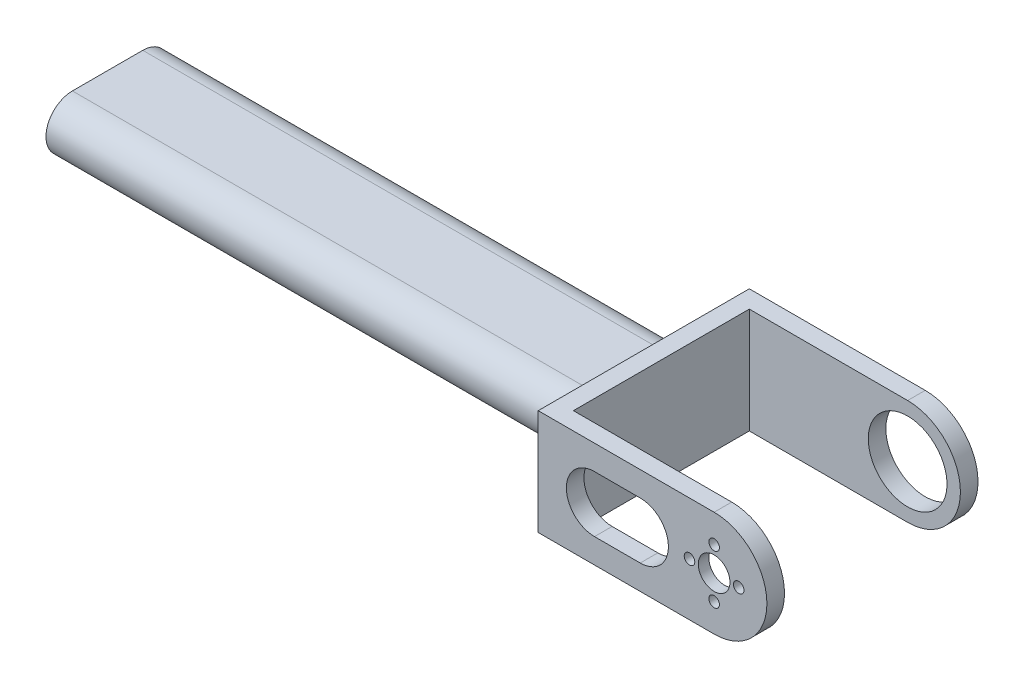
ISO-10303-21;
HEADER;
FILE_DESCRIPTION(('STEP AP214'),'2;1');
FILE_NAME('part.step','',(''),(''),'','','');
FILE_SCHEMA(('AUTOMOTIVE_DESIGN { 1 0 10303 214 1 1 1 1 }'));
ENDSEC;
DATA;
#1=APPLICATION_CONTEXT('core data for automotive mechanical design processes');
#2=APPLICATION_PROTOCOL_DEFINITION('international standard','automotive_design',2000,#1);
#3=PRODUCT_CONTEXT('',#1,'mechanical');
#4=PRODUCT('Part','Part','',(#3));
#5=PRODUCT_RELATED_PRODUCT_CATEGORY('part','',(#4));
#6=PRODUCT_DEFINITION_FORMATION('','',#4);
#7=PRODUCT_DEFINITION_CONTEXT('part definition',#1,'design');
#8=PRODUCT_DEFINITION('design','',#6,#7);
#9=PRODUCT_DEFINITION_SHAPE('','',#8);
#10=(LENGTH_UNIT() NAMED_UNIT(*) SI_UNIT(.MILLI.,.METRE.));
#11=(NAMED_UNIT(*) PLANE_ANGLE_UNIT() SI_UNIT($,.RADIAN.));
#12=(NAMED_UNIT(*) SI_UNIT($,.STERADIAN.) SOLID_ANGLE_UNIT());
#13=UNCERTAINTY_MEASURE_WITH_UNIT(LENGTH_MEASURE(1.E-05),#10,'distance_accuracy_value','');
#14=(GEOMETRIC_REPRESENTATION_CONTEXT(3) GLOBAL_UNCERTAINTY_ASSIGNED_CONTEXT((#13)) GLOBAL_UNIT_ASSIGNED_CONTEXT((#10,
#11,#12)) REPRESENTATION_CONTEXT('',''));
#15=CARTESIAN_POINT('',(0.,0.,0.));
#16=DIRECTION('',(0.,0.,1.));
#17=DIRECTION('',(1.,0.,0.));
#18=AXIS2_PLACEMENT_3D('',#15,#16,#17);
#19=CARTESIAN_POINT('',(-50.,15.,5.));
#20=DIRECTION('',(1.,0.,0.));
#21=DIRECTION('',(0.,0.,-1.));
#22=AXIS2_PLACEMENT_3D('',#19,#20,#21);
#23=PLANE('',#22);
#24=DIRECTION('',(0.,1.,0.));
#25=VECTOR('',#24,1.);
#26=CARTESIAN_POINT('',(-50.,15.,-55.));
#27=LINE('',#26,#25);
#28=CARTESIAN_POINT('',(-50.,-15.,-55.));
#29=VERTEX_POINT('',#28);
#30=CARTESIAN_POINT('',(-50.,15.,-55.));
#31=VERTEX_POINT('',#30);
#32=EDGE_CURVE('E375',#29,#31,#27,.T.);
#33=ORIENTED_EDGE('',*,*,#32,.F.);
#34=DIRECTION('',(0.,0.,-1.));
#35=VECTOR('',#34,1.);
#36=CARTESIAN_POINT('',(-50.,-15.,5.));
#37=LINE('',#36,#35);
#38=CARTESIAN_POINT('',(-50.,-15.,5.));
#39=VERTEX_POINT('',#38);
#40=EDGE_CURVE('E443',#39,#29,#37,.T.);
#41=ORIENTED_EDGE('',*,*,#40,.F.);
#42=DIRECTION('',(0.,-1.,0.));
#43=VECTOR('',#42,1.);
#44=CARTESIAN_POINT('',(-50.,15.,5.));
#45=LINE('',#44,#43);
#46=CARTESIAN_POINT('',(-50.,15.,5.));
#47=VERTEX_POINT('',#46);
#48=EDGE_CURVE('E424',#47,#39,#45,.T.);
#49=ORIENTED_EDGE('',*,*,#48,.F.);
#50=DIRECTION('',(0.,0.,-1.));
#51=VECTOR('',#50,1.);
#52=CARTESIAN_POINT('',(-50.,15.,5.));
#53=LINE('',#52,#51);
#54=EDGE_CURVE('E446',#47,#31,#53,.T.);
#55=ORIENTED_EDGE('',*,*,#54,.T.);
#56=EDGE_LOOP('',(#33,#41,#49,#55));
#57=FACE_BOUND('',#56,.T.);
#58=CARTESIAN_POINT('',(-50.,0.,-35.));
#59=DIRECTION('',(-1.,0.,0.));
#60=DIRECTION('',(0.,0.,1.));
#61=AXIS2_PLACEMENT_3D('',#58,#59,#60);
#62=CIRCLE('',#61,7.5);
#63=CARTESIAN_POINT('',(-50.,7.5,-35.));
#64=VERTEX_POINT('',#63);
#65=CARTESIAN_POINT('',(-50.,-7.5,-35.));
#66=VERTEX_POINT('',#65);
#67=EDGE_CURVE('E71',#64,#66,#62,.T.);
#68=ORIENTED_EDGE('',*,*,#67,.F.);
#69=DIRECTION('',(0.,0.,-1.));
#70=VECTOR('',#69,1.);
#71=CARTESIAN_POINT('',(-50.,7.5,-35.));
#72=LINE('',#71,#70);
#73=CARTESIAN_POINT('',(-50.,7.5,-15.));
#74=VERTEX_POINT('',#73);
#75=EDGE_CURVE('E240',#74,#64,#72,.T.);
#76=ORIENTED_EDGE('',*,*,#75,.F.);
#77=CARTESIAN_POINT('',(-50.,0.,-15.));
#78=DIRECTION('',(-1.,0.,0.));
#79=DIRECTION('',(0.,0.,1.));
#80=AXIS2_PLACEMENT_3D('',#77,#78,#79);
#81=CIRCLE('',#80,7.5);
#82=CARTESIAN_POINT('',(-50.,-7.5,-15.));
#83=VERTEX_POINT('',#82);
#84=EDGE_CURVE('E256',#83,#74,#81,.T.);
#85=ORIENTED_EDGE('',*,*,#84,.F.);
#86=DIRECTION('',(0.,0.,1.));
#87=VECTOR('',#86,1.);
#88=CARTESIAN_POINT('',(-50.,-7.5,-35.));
#89=LINE('',#88,#87);
#90=EDGE_CURVE('E252',#66,#83,#89,.T.);
#91=ORIENTED_EDGE('',*,*,#90,.F.);
#92=EDGE_LOOP('',(#68,#76,#85,#91));
#93=FACE_BOUND('',#92,.T.);
#94=ADVANCED_FACE('F46',(#57,#93),#23,.F.);
#95=CARTESIAN_POINT('',(0.,0.,5.));
#96=DIRECTION('',(0.,0.,-1.));
#97=DIRECTION('',(-1.,0.,0.));
#98=AXIS2_PLACEMENT_3D('',#95,#96,#97);
#99=CYLINDRICAL_SURFACE('',#98,4.5);
#100=CARTESIAN_POINT('',(0.,0.,5.));
#101=DIRECTION('',(0.,0.,1.));
#102=DIRECTION('',(1.,0.,0.));
#103=AXIS2_PLACEMENT_3D('',#100,#101,#102);
#104=CIRCLE('',#103,4.5);
#105=CARTESIAN_POINT('',(4.5,0.,5.));
#106=VERTEX_POINT('',#105);
#107=EDGE_CURVE('E411',#106,#106,#104,.T.);
#108=ORIENTED_EDGE('',*,*,#107,.T.);
#109=EDGE_LOOP('',(#108));
#110=FACE_BOUND('',#109,.T.);
#111=CARTESIAN_POINT('',(0.,0.,2.));
#112=DIRECTION('',(0.,0.,-1.));
#113=DIRECTION('',(-1.,0.,0.));
#114=AXIS2_PLACEMENT_3D('',#111,#112,#113);
#115=CIRCLE('',#114,4.5);
#116=CARTESIAN_POINT('',(-4.5,0.,2.));
#117=VERTEX_POINT('',#116);
#118=EDGE_CURVE('E348',#117,#117,#115,.T.);
#119=ORIENTED_EDGE('',*,*,#118,.T.);
#120=EDGE_LOOP('',(#119));
#121=FACE_BOUND('',#120,.T.);
#122=ADVANCED_FACE('F501',(#110,#121),#99,.F.);
#123=CARTESIAN_POINT('',(0.,7.,5.));
#124=DIRECTION('',(0.,0.,-1.));
#125=DIRECTION('',(-1.,0.,0.));
#126=AXIS2_PLACEMENT_3D('',#123,#124,#125);
#127=CYLINDRICAL_SURFACE('',#126,1.5);
#128=CARTESIAN_POINT('',(0.,7.,5.));
#129=DIRECTION('',(0.,0.,1.));
#130=DIRECTION('',(1.,0.,0.));
#131=AXIS2_PLACEMENT_3D('',#128,#129,#130);
#132=CIRCLE('',#131,1.5);
#133=CARTESIAN_POINT('',(1.5,7.,5.));
#134=VERTEX_POINT('',#133);
#135=EDGE_CURVE('E407',#134,#134,#132,.T.);
#136=ORIENTED_EDGE('',*,*,#135,.T.);
#137=EDGE_LOOP('',(#136));
#138=FACE_BOUND('',#137,.T.);
#139=CARTESIAN_POINT('',(0.,7.,2.));
#140=DIRECTION('',(0.,0.,-1.));
#141=DIRECTION('',(-1.,0.,0.));
#142=AXIS2_PLACEMENT_3D('',#139,#140,#141);
#143=CIRCLE('',#142,1.5);
#144=CARTESIAN_POINT('',(-1.5,7.,2.));
#145=VERTEX_POINT('',#144);
#146=EDGE_CURVE('E344',#145,#145,#143,.T.);
#147=ORIENTED_EDGE('',*,*,#146,.T.);
#148=EDGE_LOOP('',(#147));
#149=FACE_BOUND('',#148,.T.);
#150=ADVANCED_FACE('F507',(#138,#149),#127,.F.);
#151=CARTESIAN_POINT('',(7.,0.,5.));
#152=DIRECTION('',(0.,0.,-1.));
#153=DIRECTION('',(-1.,0.,0.));
#154=AXIS2_PLACEMENT_3D('',#151,#152,#153);
#155=CYLINDRICAL_SURFACE('',#154,1.5);
#156=CARTESIAN_POINT('',(7.,0.,5.));
#157=DIRECTION('',(0.,0.,1.));
#158=DIRECTION('',(1.,0.,0.));
#159=AXIS2_PLACEMENT_3D('',#156,#157,#158);
#160=CIRCLE('',#159,1.5);
#161=CARTESIAN_POINT('',(8.5,0.,5.));
#162=VERTEX_POINT('',#161);
#163=EDGE_CURVE('E403',#162,#162,#160,.T.);
#164=ORIENTED_EDGE('',*,*,#163,.T.);
#165=EDGE_LOOP('',(#164));
#166=FACE_BOUND('',#165,.T.);
#167=CARTESIAN_POINT('',(7.,0.,2.));
#168=DIRECTION('',(0.,0.,-1.));
#169=DIRECTION('',(-1.,0.,0.));
#170=AXIS2_PLACEMENT_3D('',#167,#168,#169);
#171=CIRCLE('',#170,1.5);
#172=CARTESIAN_POINT('',(5.5,0.,2.));
#173=VERTEX_POINT('',#172);
#174=EDGE_CURVE('E340',#173,#173,#171,.T.);
#175=ORIENTED_EDGE('',*,*,#174,.T.);
#176=EDGE_LOOP('',(#175));
#177=FACE_BOUND('',#176,.T.);
#178=ADVANCED_FACE('F513',(#166,#177),#155,.F.);
#179=CARTESIAN_POINT('',(0.,-7.,5.));
#180=DIRECTION('',(0.,0.,-1.));
#181=DIRECTION('',(-1.,0.,0.));
#182=AXIS2_PLACEMENT_3D('',#179,#180,#181);
#183=CYLINDRICAL_SURFACE('',#182,1.5);
#184=CARTESIAN_POINT('',(0.,-7.,5.));
#185=DIRECTION('',(0.,0.,1.));
#186=DIRECTION('',(1.,0.,0.));
#187=AXIS2_PLACEMENT_3D('',#184,#185,#186);
#188=CIRCLE('',#187,1.5);
#189=CARTESIAN_POINT('',(1.49999999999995,-7.,5.));
#190=VERTEX_POINT('',#189);
#191=EDGE_CURVE('E399',#190,#190,#188,.T.);
#192=ORIENTED_EDGE('',*,*,#191,.T.);
#193=EDGE_LOOP('',(#192));
#194=FACE_BOUND('',#193,.T.);
#195=CARTESIAN_POINT('',(0.,-7.,2.));
#196=DIRECTION('',(0.,0.,-1.));
#197=DIRECTION('',(-1.,0.,0.));
#198=AXIS2_PLACEMENT_3D('',#195,#196,#197);
#199=CIRCLE('',#198,1.5);
#200=CARTESIAN_POINT('',(-1.50000000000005,-7.,2.));
#201=VERTEX_POINT('',#200);
#202=EDGE_CURVE('E336',#201,#201,#199,.T.);
#203=ORIENTED_EDGE('',*,*,#202,.T.);
#204=EDGE_LOOP('',(#203));
#205=FACE_BOUND('',#204,.T.);
#206=ADVANCED_FACE('F554',(#194,#205),#183,.F.);
#207=CARTESIAN_POINT('',(-7.,0.,5.));
#208=DIRECTION('',(0.,0.,-1.));
#209=DIRECTION('',(-1.,0.,0.));
#210=AXIS2_PLACEMENT_3D('',#207,#208,#209);
#211=CYLINDRICAL_SURFACE('',#210,1.5);
#212=CARTESIAN_POINT('',(-7.,0.,5.));
#213=DIRECTION('',(0.,0.,1.));
#214=DIRECTION('',(1.,0.,0.));
#215=AXIS2_PLACEMENT_3D('',#212,#213,#214);
#216=CIRCLE('',#215,1.5);
#217=CARTESIAN_POINT('',(-5.5,0.,5.));
#218=VERTEX_POINT('',#217);
#219=EDGE_CURVE('E395',#218,#218,#216,.T.);
#220=ORIENTED_EDGE('',*,*,#219,.T.);
#221=EDGE_LOOP('',(#220));
#222=FACE_BOUND('',#221,.T.);
#223=CARTESIAN_POINT('',(-7.,0.,2.));
#224=DIRECTION('',(0.,0.,-1.));
#225=DIRECTION('',(-1.,0.,0.));
#226=AXIS2_PLACEMENT_3D('',#223,#224,#225);
#227=CIRCLE('',#226,1.5);
#228=CARTESIAN_POINT('',(-8.5,0.,2.));
#229=VERTEX_POINT('',#228);
#230=EDGE_CURVE('E50',#229,#229,#227,.T.);
#231=ORIENTED_EDGE('',*,*,#230,.T.);
#232=EDGE_LOOP('',(#231));
#233=FACE_BOUND('',#232,.T.);
#234=ADVANCED_FACE('F527',(#222,#233),#211,.F.);
#235=CARTESIAN_POINT('',(-45.,15.,-55.));
#236=DIRECTION('',(-1.,0.,0.));
#237=DIRECTION('',(0.,-1.,0.));
#238=AXIS2_PLACEMENT_3D('',#235,#236,#237);
#239=PLANE('',#238);
#240=DIRECTION('',(0.,-1.,0.));
#241=VECTOR('',#240,1.);
#242=CARTESIAN_POINT('',(-45.,15.,-50.));
#243=LINE('',#242,#241);
#244=CARTESIAN_POINT('',(-45.,15.,-50.));
#245=VERTEX_POINT('',#244);
#246=CARTESIAN_POINT('',(-45.,-15.,-50.));
#247=VERTEX_POINT('',#246);
#248=EDGE_CURVE('E11',#245,#247,#243,.T.);
#249=ORIENTED_EDGE('',*,*,#248,.F.);
#250=DIRECTION('',(0.,0.,1.));
#251=VECTOR('',#250,1.);
#252=CARTESIAN_POINT('',(-45.,15.,-55.));
#253=LINE('',#252,#251);
#254=CARTESIAN_POINT('',(-45.,15.,0.));
#255=VERTEX_POINT('',#254);
#256=EDGE_CURVE('E392',#245,#255,#253,.T.);
#257=ORIENTED_EDGE('',*,*,#256,.T.);
#258=DIRECTION('',(0.,-1.,0.));
#259=VECTOR('',#258,1.);
#260=CARTESIAN_POINT('',(-45.,15.,0.));
#261=LINE('',#260,#259);
#262=CARTESIAN_POINT('',(-45.,-15.,0.));
#263=VERTEX_POINT('',#262);
#264=EDGE_CURVE('E374',#255,#263,#261,.T.);
#265=ORIENTED_EDGE('',*,*,#264,.T.);
#266=DIRECTION('',(0.,0.,1.));
#267=VECTOR('',#266,1.);
#268=CARTESIAN_POINT('',(-45.,-15.,-55.));
#269=LINE('',#268,#267);
#270=EDGE_CURVE('E386',#247,#263,#269,.T.);
#271=ORIENTED_EDGE('',*,*,#270,.F.);
#272=EDGE_LOOP('',(#249,#257,#265,#271));
#273=FACE_BOUND('',#272,.T.);
#274=ADVANCED_FACE('F466',(#273),#239,.F.);
#275=CARTESIAN_POINT('',(0.,0.,0.));
#276=DIRECTION('',(0.,0.,1.));
#277=DIRECTION('',(1.,0.,0.));
#278=AXIS2_PLACEMENT_3D('',#275,#276,#277);
#279=PLANE('',#278);
#280=DIRECTION('',(1.,0.,0.));
#281=VECTOR('',#280,1.);
#282=CARTESIAN_POINT('',(-34.,8.00000000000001,0.));
#283=LINE('',#282,#281);
#284=CARTESIAN_POINT('',(-34.,8.00000000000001,0.));
#285=VERTEX_POINT('',#284);
#286=CARTESIAN_POINT('',(-21.,8.00000000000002,0.));
#287=VERTEX_POINT('',#286);
#288=EDGE_CURVE('E310',#285,#287,#283,.T.);
#289=ORIENTED_EDGE('',*,*,#288,.F.);
#290=CARTESIAN_POINT('',(-34.,0.,0.));
#291=DIRECTION('',(0.,0.,1.));
#292=DIRECTION('',(1.,0.,0.));
#293=AXIS2_PLACEMENT_3D('',#290,#291,#292);
#294=CIRCLE('',#293,8.00000000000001);
#295=CARTESIAN_POINT('',(-34.,-8.00000000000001,0.));
#296=VERTEX_POINT('',#295);
#297=EDGE_CURVE('E290',#296,#285,#294,.F.);
#298=ORIENTED_EDGE('',*,*,#297,.F.);
#299=DIRECTION('',(-1.,0.,0.));
#300=VECTOR('',#299,1.);
#301=CARTESIAN_POINT('',(-34.,-8.00000000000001,0.));
#302=LINE('',#301,#300);
#303=CARTESIAN_POINT('',(-21.,-8.00000000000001,0.));
#304=VERTEX_POINT('',#303);
#305=EDGE_CURVE('E286',#304,#296,#302,.T.);
#306=ORIENTED_EDGE('',*,*,#305,.F.);
#307=CARTESIAN_POINT('',(-21.,0.,0.));
#308=DIRECTION('',(0.,0.,1.));
#309=DIRECTION('',(1.,0.,0.));
#310=AXIS2_PLACEMENT_3D('',#307,#308,#309);
#311=CIRCLE('',#310,8.00000000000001);
#312=EDGE_CURVE('E314',#287,#304,#311,.F.);
#313=ORIENTED_EDGE('',*,*,#312,.F.);
#314=EDGE_LOOP('',(#289,#298,#306,#313));
#315=FACE_BOUND('',#314,.T.);
#316=CARTESIAN_POINT('',(0.,0.,0.));
#317=DIRECTION('',(0.,0.,-1.));
#318=DIRECTION('',(-1.,0.,0.));
#319=AXIS2_PLACEMENT_3D('',#316,#317,#318);
#320=CIRCLE('',#319,10.19);
#321=CARTESIAN_POINT('',(-10.19,0.,0.));
#322=VERTEX_POINT('',#321);
#323=EDGE_CURVE('E317',#322,#322,#320,.T.);
#324=ORIENTED_EDGE('',*,*,#323,.F.);
#325=EDGE_LOOP('',(#324));
#326=FACE_BOUND('',#325,.T.);
#327=ORIENTED_EDGE('',*,*,#264,.F.);
#328=DIRECTION('',(-1.,0.,0.));
#329=VECTOR('',#328,1.);
#330=CARTESIAN_POINT('',(0.,15.,0.));
#331=LINE('',#330,#329);
#332=CARTESIAN_POINT('',(0.,15.,0.));
#333=VERTEX_POINT('',#332);
#334=EDGE_CURVE('E434',#333,#255,#331,.T.);
#335=ORIENTED_EDGE('',*,*,#334,.F.);
#336=CARTESIAN_POINT('',(0.,0.,0.));
#337=DIRECTION('',(0.,0.,1.));
#338=DIRECTION('',(1.,0.,0.));
#339=AXIS2_PLACEMENT_3D('',#336,#337,#338);
#340=CIRCLE('',#339,15.);
#341=CARTESIAN_POINT('',(0.,-15.,0.));
#342=VERTEX_POINT('',#341);
#343=EDGE_CURVE('E415',#342,#333,#340,.T.);
#344=ORIENTED_EDGE('',*,*,#343,.F.);
#345=DIRECTION('',(1.,0.,0.));
#346=VECTOR('',#345,1.);
#347=CARTESIAN_POINT('',(-50.,-15.,0.));
#348=LINE('',#347,#346);
#349=EDGE_CURVE('E421',#263,#342,#348,.T.);
#350=ORIENTED_EDGE('',*,*,#349,.F.);
#351=EDGE_LOOP('',(#327,#335,#344,#350));
#352=FACE_BOUND('',#351,.T.);
#353=ADVANCED_FACE('F464',(#315,#326,#352),#279,.F.);
#354=CARTESIAN_POINT('',(0.,0.,5.));
#355=DIRECTION('',(0.,0.,1.));
#356=DIRECTION('',(1.,0.,0.));
#357=AXIS2_PLACEMENT_3D('',#354,#355,#356);
#358=PLANE('',#357);
#359=CARTESIAN_POINT('',(-34.,0.,5.));
#360=DIRECTION('',(0.,0.,1.));
#361=DIRECTION('',(1.,0.,0.));
#362=AXIS2_PLACEMENT_3D('',#359,#360,#361);
#363=CIRCLE('',#362,8.00000000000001);
#364=CARTESIAN_POINT('',(-34.,8.00000000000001,5.));
#365=VERTEX_POINT('',#364);
#366=CARTESIAN_POINT('',(-34.,-8.00000000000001,5.));
#367=VERTEX_POINT('',#366);
#368=EDGE_CURVE('E303',#365,#367,#363,.T.);
#369=ORIENTED_EDGE('',*,*,#368,.F.);
#370=DIRECTION('',(-1.,0.,0.));
#371=VECTOR('',#370,1.);
#372=CARTESIAN_POINT('',(-34.,8.00000000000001,5.));
#373=LINE('',#372,#371);
#374=CARTESIAN_POINT('',(-21.,8.00000000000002,5.));
#375=VERTEX_POINT('',#374);
#376=EDGE_CURVE('E291',#375,#365,#373,.T.);
#377=ORIENTED_EDGE('',*,*,#376,.F.);
#378=CARTESIAN_POINT('',(-21.,0.,5.));
#379=DIRECTION('',(0.,0.,1.));
#380=DIRECTION('',(1.,0.,0.));
#381=AXIS2_PLACEMENT_3D('',#378,#379,#380);
#382=CIRCLE('',#381,8.00000000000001);
#383=CARTESIAN_POINT('',(-21.,-8.00000000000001,5.));
#384=VERTEX_POINT('',#383);
#385=EDGE_CURVE('E295',#384,#375,#382,.T.);
#386=ORIENTED_EDGE('',*,*,#385,.F.);
#387=DIRECTION('',(1.,0.,0.));
#388=VECTOR('',#387,1.);
#389=CARTESIAN_POINT('',(-34.,-8.00000000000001,5.));
#390=LINE('',#389,#388);
#391=EDGE_CURVE('E299',#367,#384,#390,.T.);
#392=ORIENTED_EDGE('',*,*,#391,.F.);
#393=EDGE_LOOP('',(#369,#377,#386,#392));
#394=FACE_BOUND('',#393,.T.);
#395=ORIENTED_EDGE('',*,*,#191,.F.);
#396=EDGE_LOOP('',(#395));
#397=FACE_BOUND('',#396,.T.);
#398=ORIENTED_EDGE('',*,*,#135,.F.);
#399=EDGE_LOOP('',(#398));
#400=FACE_BOUND('',#399,.T.);
#401=CARTESIAN_POINT('',(0.,0.,5.));
#402=DIRECTION('',(0.,0.,1.));
#403=DIRECTION('',(1.,0.,0.));
#404=AXIS2_PLACEMENT_3D('',#401,#402,#403);
#405=CIRCLE('',#404,15.);
#406=CARTESIAN_POINT('',(0.,-15.,5.));
#407=VERTEX_POINT('',#406);
#408=CARTESIAN_POINT('',(0.,15.,5.));
#409=VERTEX_POINT('',#408);
#410=EDGE_CURVE('E416',#407,#409,#405,.T.);
#411=ORIENTED_EDGE('',*,*,#410,.T.);
#412=DIRECTION('',(-1.,0.,0.));
#413=VECTOR('',#412,1.);
#414=CARTESIAN_POINT('',(0.,15.,5.));
#415=LINE('',#414,#413);
#416=EDGE_CURVE('E420',#409,#47,#415,.T.);
#417=ORIENTED_EDGE('',*,*,#416,.T.);
#418=ORIENTED_EDGE('',*,*,#48,.T.);
#419=DIRECTION('',(1.,0.,0.));
#420=VECTOR('',#419,1.);
#421=CARTESIAN_POINT('',(-50.,-15.,5.));
#422=LINE('',#421,#420);
#423=EDGE_CURVE('E427',#39,#407,#422,.T.);
#424=ORIENTED_EDGE('',*,*,#423,.T.);
#425=EDGE_LOOP('',(#411,#417,#418,#424));
#426=FACE_BOUND('',#425,.T.);
#427=ORIENTED_EDGE('',*,*,#107,.F.);
#428=EDGE_LOOP('',(#427));
#429=FACE_BOUND('',#428,.T.);
#430=ORIENTED_EDGE('',*,*,#163,.F.);
#431=EDGE_LOOP('',(#430));
#432=FACE_BOUND('',#431,.T.);
#433=ORIENTED_EDGE('',*,*,#219,.F.);
#434=EDGE_LOOP('',(#433));
#435=FACE_BOUND('',#434,.T.);
#436=ADVANCED_FACE('F485',(#394,#397,#400,#426,#429,#432,#435),#358,.T.);
#437=CARTESIAN_POINT('',(0.,0.,5.));
#438=DIRECTION('',(0.,0.,-1.));
#439=DIRECTION('',(-1.,0.,0.));
#440=AXIS2_PLACEMENT_3D('',#437,#438,#439);
#441=CYLINDRICAL_SURFACE('',#440,15.);
#442=ORIENTED_EDGE('',*,*,#343,.T.);
#443=DIRECTION('',(0.,0.,-1.));
#444=VECTOR('',#443,1.);
#445=CARTESIAN_POINT('',(0.,15.,5.));
#446=LINE('',#445,#444);
#447=EDGE_CURVE('E56',#409,#333,#446,.T.);
#448=ORIENTED_EDGE('',*,*,#447,.F.);
#449=ORIENTED_EDGE('',*,*,#410,.F.);
#450=DIRECTION('',(0.,0.,-1.));
#451=VECTOR('',#450,1.);
#452=CARTESIAN_POINT('',(0.,-15.,5.));
#453=LINE('',#452,#451);
#454=EDGE_CURVE('E430',#407,#342,#453,.T.);
#455=ORIENTED_EDGE('',*,*,#454,.T.);
#456=EDGE_LOOP('',(#442,#448,#449,#455));
#457=FACE_BOUND('',#456,.T.);
#458=ADVANCED_FACE('F48',(#457),#441,.T.);
#459=CARTESIAN_POINT('',(0.,15.,5.));
#460=DIRECTION('',(0.,-1.,0.));
#461=DIRECTION('',(1.,0.,0.));
#462=AXIS2_PLACEMENT_3D('',#459,#460,#461);
#463=PLANE('',#462);
#464=DIRECTION('',(1.,0.,0.));
#465=VECTOR('',#464,1.);
#466=CARTESIAN_POINT('',(-50.,15.,-55.));
#467=LINE('',#466,#465);
#468=CARTESIAN_POINT('',(0.,15.,-55.));
#469=VERTEX_POINT('',#468);
#470=EDGE_CURVE('E379',#31,#469,#467,.T.);
#471=ORIENTED_EDGE('',*,*,#470,.F.);
#472=ORIENTED_EDGE('',*,*,#54,.F.);
#473=ORIENTED_EDGE('',*,*,#416,.F.);
#474=ORIENTED_EDGE('',*,*,#447,.T.);
#475=ORIENTED_EDGE('',*,*,#334,.T.);
#476=ORIENTED_EDGE('',*,*,#256,.F.);
#477=DIRECTION('',(-1.,0.,0.));
#478=VECTOR('',#477,1.);
#479=CARTESIAN_POINT('',(0.,15.,-50.));
#480=LINE('',#479,#478);
#481=CARTESIAN_POINT('',(0.,15.,-50.));
#482=VERTEX_POINT('',#481);
#483=EDGE_CURVE('E358',#482,#245,#480,.T.);
#484=ORIENTED_EDGE('',*,*,#483,.F.);
#485=DIRECTION('',(0.,0.,1.));
#486=VECTOR('',#485,1.);
#487=CARTESIAN_POINT('',(0.,15.,-55.));
#488=LINE('',#487,#486);
#489=EDGE_CURVE('E357',#469,#482,#488,.T.);
#490=ORIENTED_EDGE('',*,*,#489,.F.);
#491=EDGE_LOOP('',(#471,#472,#473,#474,#475,#476,#484,#490));
#492=FACE_BOUND('',#491,.T.);
#493=ADVANCED_FACE('F454',(#492),#463,.F.);
#494=CARTESIAN_POINT('',(-50.,-15.,5.));
#495=DIRECTION('',(0.,1.,0.));
#496=DIRECTION('',(-1.,0.,0.));
#497=AXIS2_PLACEMENT_3D('',#494,#495,#496);
#498=PLANE('',#497);
#499=DIRECTION('',(-1.,0.,0.));
#500=VECTOR('',#499,1.);
#501=CARTESIAN_POINT('',(-50.,-15.,-55.));
#502=LINE('',#501,#500);
#503=CARTESIAN_POINT('',(0.,-15.,-55.));
#504=VERTEX_POINT('',#503);
#505=EDGE_CURVE('E382',#504,#29,#502,.T.);
#506=ORIENTED_EDGE('',*,*,#505,.F.);
#507=DIRECTION('',(0.,0.,1.));
#508=VECTOR('',#507,1.);
#509=CARTESIAN_POINT('',(0.,-15.,-55.));
#510=LINE('',#509,#508);
#511=CARTESIAN_POINT('',(0.,-15.,-50.));
#512=VERTEX_POINT('',#511);
#513=EDGE_CURVE('E370',#504,#512,#510,.T.);
#514=ORIENTED_EDGE('',*,*,#513,.T.);
#515=DIRECTION('',(1.,0.,0.));
#516=VECTOR('',#515,1.);
#517=CARTESIAN_POINT('',(-50.,-15.,-50.));
#518=LINE('',#517,#516);
#519=EDGE_CURVE('E362',#247,#512,#518,.T.);
#520=ORIENTED_EDGE('',*,*,#519,.F.);
#521=ORIENTED_EDGE('',*,*,#270,.T.);
#522=ORIENTED_EDGE('',*,*,#349,.T.);
#523=ORIENTED_EDGE('',*,*,#454,.F.);
#524=ORIENTED_EDGE('',*,*,#423,.F.);
#525=ORIENTED_EDGE('',*,*,#40,.T.);
#526=EDGE_LOOP('',(#506,#514,#520,#521,#522,#523,#524,#525));
#527=FACE_BOUND('',#526,.T.);
#528=ADVANCED_FACE('F488',(#527),#498,.F.);
#529=CARTESIAN_POINT('',(0.,0.,-55.));
#530=DIRECTION('',(0.,0.,1.));
#531=DIRECTION('',(1.,0.,0.));
#532=AXIS2_PLACEMENT_3D('',#529,#530,#531);
#533=PLANE('',#532);
#534=CARTESIAN_POINT('',(0.,0.,-55.));
#535=DIRECTION('',(0.,0.,-1.));
#536=DIRECTION('',(-1.,0.,0.));
#537=AXIS2_PLACEMENT_3D('',#534,#535,#536);
#538=CIRCLE('',#537,11.19);
#539=CARTESIAN_POINT('',(-11.19,0.,-55.));
#540=VERTEX_POINT('',#539);
#541=EDGE_CURVE('E277',#540,#540,#538,.T.);
#542=ORIENTED_EDGE('',*,*,#541,.F.);
#543=EDGE_LOOP('',(#542));
#544=FACE_BOUND('',#543,.T.);
#545=ORIENTED_EDGE('',*,*,#32,.T.);
#546=ORIENTED_EDGE('',*,*,#470,.T.);
#547=CARTESIAN_POINT('',(0.,0.,-55.));
#548=DIRECTION('',(0.,0.,1.));
#549=DIRECTION('',(1.,0.,0.));
#550=AXIS2_PLACEMENT_3D('',#547,#548,#549);
#551=CIRCLE('',#550,15.);
#552=EDGE_CURVE('E353',#504,#469,#551,.T.);
#553=ORIENTED_EDGE('',*,*,#552,.F.);
#554=ORIENTED_EDGE('',*,*,#505,.T.);
#555=EDGE_LOOP('',(#545,#546,#553,#554));
#556=FACE_BOUND('',#555,.T.);
#557=ADVANCED_FACE('F480',(#544,#556),#533,.F.);
#558=CARTESIAN_POINT('',(0.,0.,-50.));
#559=DIRECTION('',(0.,0.,-1.));
#560=DIRECTION('',(1.,0.,0.));
#561=AXIS2_PLACEMENT_3D('',#558,#559,#560);
#562=PLANE('',#561);
#563=CARTESIAN_POINT('',(0.,0.,-50.));
#564=DIRECTION('',(0.,0.,-1.));
#565=DIRECTION('',(-1.,0.,0.));
#566=AXIS2_PLACEMENT_3D('',#563,#564,#565);
#567=CIRCLE('',#566,11.19);
#568=CARTESIAN_POINT('',(-11.19,0.,-50.));
#569=VERTEX_POINT('',#568);
#570=EDGE_CURVE('E281',#569,#569,#567,.F.);
#571=ORIENTED_EDGE('',*,*,#570,.F.);
#572=EDGE_LOOP('',(#571));
#573=FACE_BOUND('',#572,.T.);
#574=ORIENTED_EDGE('',*,*,#483,.T.);
#575=ORIENTED_EDGE('',*,*,#248,.T.);
#576=ORIENTED_EDGE('',*,*,#519,.T.);
#577=CARTESIAN_POINT('',(0.,0.,-50.));
#578=DIRECTION('',(0.,0.,1.));
#579=DIRECTION('',(1.,0.,0.));
#580=AXIS2_PLACEMENT_3D('',#577,#578,#579);
#581=CIRCLE('',#580,15.);
#582=EDGE_CURVE('E352',#512,#482,#581,.T.);
#583=ORIENTED_EDGE('',*,*,#582,.T.);
#584=EDGE_LOOP('',(#574,#575,#576,#583));
#585=FACE_BOUND('',#584,.T.);
#586=ADVANCED_FACE('F470',(#573,#585),#562,.F.);
#587=CARTESIAN_POINT('',(0.,0.,-55.));
#588=DIRECTION('',(0.,0.,1.));
#589=DIRECTION('',(1.,0.,0.));
#590=AXIS2_PLACEMENT_3D('',#587,#588,#589);
#591=CYLINDRICAL_SURFACE('',#590,15.);
#592=ORIENTED_EDGE('',*,*,#582,.F.);
#593=ORIENTED_EDGE('',*,*,#513,.F.);
#594=ORIENTED_EDGE('',*,*,#552,.T.);
#595=ORIENTED_EDGE('',*,*,#489,.T.);
#596=EDGE_LOOP('',(#592,#593,#594,#595));
#597=FACE_BOUND('',#596,.T.);
#598=ADVANCED_FACE('F475',(#597),#591,.T.);
#599=CARTESIAN_POINT('',(0.,0.,2.));
#600=DIRECTION('',(0.,0.,-1.));
#601=DIRECTION('',(-1.,0.,0.));
#602=AXIS2_PLACEMENT_3D('',#599,#600,#601);
#603=CYLINDRICAL_SURFACE('',#602,10.19);
#604=CARTESIAN_POINT('',(0.,0.,2.));
#605=DIRECTION('',(0.,0.,-1.));
#606=DIRECTION('',(-1.,0.,0.));
#607=AXIS2_PLACEMENT_3D('',#604,#605,#606);
#608=CIRCLE('',#607,10.19);
#609=CARTESIAN_POINT('',(-10.19,0.,2.));
#610=VERTEX_POINT('',#609);
#611=EDGE_CURVE('E329',#610,#610,#608,.T.);
#612=ORIENTED_EDGE('',*,*,#611,.F.);
#613=EDGE_LOOP('',(#612));
#614=FACE_BOUND('',#613,.T.);
#615=ORIENTED_EDGE('',*,*,#323,.T.);
#616=EDGE_LOOP('',(#615));
#617=FACE_BOUND('',#616,.T.);
#618=ADVANCED_FACE('F535',(#614,#617),#603,.F.);
#619=CARTESIAN_POINT('',(0.,0.,2.));
#620=DIRECTION('',(0.,0.,-1.));
#621=DIRECTION('',(-1.,0.,0.));
#622=AXIS2_PLACEMENT_3D('',#619,#620,#621);
#623=PLANE('',#622);
#624=ORIENTED_EDGE('',*,*,#118,.F.);
#625=EDGE_LOOP('',(#624));
#626=FACE_BOUND('',#625,.T.);
#627=ORIENTED_EDGE('',*,*,#146,.F.);
#628=EDGE_LOOP('',(#627));
#629=FACE_BOUND('',#628,.T.);
#630=ORIENTED_EDGE('',*,*,#174,.F.);
#631=EDGE_LOOP('',(#630));
#632=FACE_BOUND('',#631,.T.);
#633=ORIENTED_EDGE('',*,*,#202,.F.);
#634=EDGE_LOOP('',(#633));
#635=FACE_BOUND('',#634,.T.);
#636=ORIENTED_EDGE('',*,*,#230,.F.);
#637=EDGE_LOOP('',(#636));
#638=FACE_BOUND('',#637,.T.);
#639=ORIENTED_EDGE('',*,*,#611,.T.);
#640=EDGE_LOOP('',(#639));
#641=FACE_BOUND('',#640,.T.);
#642=ADVANCED_FACE('F537',(#626,#629,#632,#635,#638,#641),#623,.T.);
#643=CARTESIAN_POINT('',(-34.,0.,-55.001));
#644=DIRECTION('',(0.,0.,1.));
#645=DIRECTION('',(1.,0.,0.));
#646=AXIS2_PLACEMENT_3D('',#643,#644,#645);
#647=CYLINDRICAL_SURFACE('',#646,8.00000000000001);
#648=ORIENTED_EDGE('',*,*,#297,.T.);
#649=DIRECTION('',(0.,0.,1.));
#650=VECTOR('',#649,1.);
#651=CARTESIAN_POINT('',(-34.,8.00000000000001,-55.001));
#652=LINE('',#651,#650);
#653=EDGE_CURVE('E318',#285,#365,#652,.T.);
#654=ORIENTED_EDGE('',*,*,#653,.T.);
#655=ORIENTED_EDGE('',*,*,#368,.T.);
#656=DIRECTION('',(0.,0.,1.));
#657=VECTOR('',#656,1.);
#658=CARTESIAN_POINT('',(-34.,-8.00000000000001,-55.001));
#659=LINE('',#658,#657);
#660=EDGE_CURVE('E285',#296,#367,#659,.T.);
#661=ORIENTED_EDGE('',*,*,#660,.F.);
#662=EDGE_LOOP('',(#648,#654,#655,#661));
#663=FACE_BOUND('',#662,.T.);
#664=ADVANCED_FACE('F543',(#663),#647,.F.);
#665=CARTESIAN_POINT('',(-34.,8.00000000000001,-55.001));
#666=DIRECTION('',(0.,1.,0.));
#667=DIRECTION('',(-1.,0.,0.));
#668=AXIS2_PLACEMENT_3D('',#665,#666,#667);
#669=PLANE('',#668);
#670=ORIENTED_EDGE('',*,*,#288,.T.);
#671=DIRECTION('',(0.,0.,1.));
#672=VECTOR('',#671,1.);
#673=CARTESIAN_POINT('',(-21.,8.00000000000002,-55.001));
#674=LINE('',#673,#672);
#675=EDGE_CURVE('E321',#287,#375,#674,.T.);
#676=ORIENTED_EDGE('',*,*,#675,.T.);
#677=ORIENTED_EDGE('',*,*,#376,.T.);
#678=ORIENTED_EDGE('',*,*,#653,.F.);
#679=EDGE_LOOP('',(#670,#676,#677,#678));
#680=FACE_BOUND('',#679,.T.);
#681=ADVANCED_FACE('F647',(#680),#669,.F.);
#682=CARTESIAN_POINT('',(-21.,0.,-55.001));
#683=DIRECTION('',(0.,0.,1.));
#684=DIRECTION('',(1.,0.,0.));
#685=AXIS2_PLACEMENT_3D('',#682,#683,#684);
#686=CYLINDRICAL_SURFACE('',#685,8.00000000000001);
#687=ORIENTED_EDGE('',*,*,#312,.T.);
#688=DIRECTION('',(0.,0.,1.));
#689=VECTOR('',#688,1.);
#690=CARTESIAN_POINT('',(-21.,-8.00000000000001,-55.001));
#691=LINE('',#690,#689);
#692=EDGE_CURVE('E306',#304,#384,#691,.T.);
#693=ORIENTED_EDGE('',*,*,#692,.T.);
#694=ORIENTED_EDGE('',*,*,#385,.T.);
#695=ORIENTED_EDGE('',*,*,#675,.F.);
#696=EDGE_LOOP('',(#687,#693,#694,#695));
#697=FACE_BOUND('',#696,.T.);
#698=ADVANCED_FACE('F656',(#697),#686,.F.);
#699=CARTESIAN_POINT('',(-34.,-8.00000000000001,-55.001));
#700=DIRECTION('',(0.,-1.,0.));
#701=DIRECTION('',(1.,0.,0.));
#702=AXIS2_PLACEMENT_3D('',#699,#700,#701);
#703=PLANE('',#702);
#704=ORIENTED_EDGE('',*,*,#305,.T.);
#705=ORIENTED_EDGE('',*,*,#660,.T.);
#706=ORIENTED_EDGE('',*,*,#391,.T.);
#707=ORIENTED_EDGE('',*,*,#692,.F.);
#708=EDGE_LOOP('',(#704,#705,#706,#707));
#709=FACE_BOUND('',#708,.T.);
#710=ADVANCED_FACE('F665',(#709),#703,.F.);
#711=CARTESIAN_POINT('',(0.,0.,5.001));
#712=DIRECTION('',(0.,0.,-1.));
#713=DIRECTION('',(-1.,0.,0.));
#714=AXIS2_PLACEMENT_3D('',#711,#712,#713);
#715=CYLINDRICAL_SURFACE('',#714,11.19);
#716=ORIENTED_EDGE('',*,*,#541,.T.);
#717=EDGE_LOOP('',(#716));
#718=FACE_BOUND('',#717,.T.);
#719=ORIENTED_EDGE('',*,*,#570,.T.);
#720=EDGE_LOOP('',(#719));
#721=FACE_BOUND('',#720,.T.);
#722=ADVANCED_FACE('F673',(#718,#721),#715,.F.);
#723=CARTESIAN_POINT('',(-202.4,0.,-35.));
#724=DIRECTION('',(1.,0.,0.));
#725=DIRECTION('',(0.,0.,-1.));
#726=AXIS2_PLACEMENT_3D('',#723,#724,#725);
#727=CYLINDRICAL_SURFACE('',#726,7.5);
#728=ORIENTED_EDGE('',*,*,#67,.T.);
#729=DIRECTION('',(1.,0.,0.));
#730=VECTOR('',#729,1.);
#731=CARTESIAN_POINT('',(-202.4,-7.5,-35.));
#732=LINE('',#731,#730);
#733=CARTESIAN_POINT('',(-202.4,-7.5,-35.));
#734=VERTEX_POINT('',#733);
#735=EDGE_CURVE('E273',#734,#66,#732,.T.);
#736=ORIENTED_EDGE('',*,*,#735,.F.);
#737=CARTESIAN_POINT('',(-202.4,0.,-35.));
#738=DIRECTION('',(-1.,0.,0.));
#739=DIRECTION('',(0.,0.,1.));
#740=AXIS2_PLACEMENT_3D('',#737,#738,#739);
#741=CIRCLE('',#740,7.5);
#742=CARTESIAN_POINT('',(-202.4,7.5,-35.));
#743=VERTEX_POINT('',#742);
#744=EDGE_CURVE('E235',#743,#734,#741,.T.);
#745=ORIENTED_EDGE('',*,*,#744,.F.);
#746=DIRECTION('',(1.,0.,0.));
#747=VECTOR('',#746,1.);
#748=CARTESIAN_POINT('',(-202.4,7.5,-35.));
#749=LINE('',#748,#747);
#750=EDGE_CURVE('E249',#743,#64,#749,.T.);
#751=ORIENTED_EDGE('',*,*,#750,.T.);
#752=EDGE_LOOP('',(#728,#736,#745,#751));
#753=FACE_BOUND('',#752,.T.);
#754=ADVANCED_FACE('F685',(#753),#727,.T.);
#755=CARTESIAN_POINT('',(-202.4,-7.5,-35.));
#756=DIRECTION('',(0.,1.,0.));
#757=DIRECTION('',(0.,0.,1.));
#758=AXIS2_PLACEMENT_3D('',#755,#756,#757);
#759=PLANE('',#758);
#760=ORIENTED_EDGE('',*,*,#90,.T.);
#761=DIRECTION('',(1.,0.,0.));
#762=VECTOR('',#761,1.);
#763=CARTESIAN_POINT('',(-202.4,-7.5,-15.));
#764=LINE('',#763,#762);
#765=CARTESIAN_POINT('',(-202.4,-7.5,-15.));
#766=VERTEX_POINT('',#765);
#767=EDGE_CURVE('E269',#766,#83,#764,.T.);
#768=ORIENTED_EDGE('',*,*,#767,.F.);
#769=DIRECTION('',(0.,0.,1.));
#770=VECTOR('',#769,1.);
#771=CARTESIAN_POINT('',(-202.4,-7.5,-35.));
#772=LINE('',#771,#770);
#773=EDGE_CURVE('E239',#734,#766,#772,.T.);
#774=ORIENTED_EDGE('',*,*,#773,.F.);
#775=ORIENTED_EDGE('',*,*,#735,.T.);
#776=EDGE_LOOP('',(#760,#768,#774,#775));
#777=FACE_BOUND('',#776,.T.);
#778=ADVANCED_FACE('F704',(#777),#759,.F.);
#779=CARTESIAN_POINT('',(-202.4,0.,-15.));
#780=DIRECTION('',(1.,0.,0.));
#781=DIRECTION('',(0.,0.,-1.));
#782=AXIS2_PLACEMENT_3D('',#779,#780,#781);
#783=CYLINDRICAL_SURFACE('',#782,7.5);
#784=ORIENTED_EDGE('',*,*,#84,.T.);
#785=DIRECTION('',(1.,0.,0.));
#786=VECTOR('',#785,1.);
#787=CARTESIAN_POINT('',(-202.4,7.5,-15.));
#788=LINE('',#787,#786);
#789=CARTESIAN_POINT('',(-202.4,7.5,-15.));
#790=VERTEX_POINT('',#789);
#791=EDGE_CURVE('E265',#790,#74,#788,.T.);
#792=ORIENTED_EDGE('',*,*,#791,.F.);
#793=CARTESIAN_POINT('',(-202.4,0.,-15.));
#794=DIRECTION('',(-1.,0.,0.));
#795=DIRECTION('',(0.,0.,1.));
#796=AXIS2_PLACEMENT_3D('',#793,#794,#795);
#797=CIRCLE('',#796,7.5);
#798=EDGE_CURVE('E243',#766,#790,#797,.T.);
#799=ORIENTED_EDGE('',*,*,#798,.F.);
#800=ORIENTED_EDGE('',*,*,#767,.T.);
#801=EDGE_LOOP('',(#784,#792,#799,#800));
#802=FACE_BOUND('',#801,.T.);
#803=ADVANCED_FACE('F714',(#802),#783,.T.);
#804=CARTESIAN_POINT('',(-202.4,7.5,-35.));
#805=DIRECTION('',(0.,-1.,0.));
#806=DIRECTION('',(0.,0.,-1.));
#807=AXIS2_PLACEMENT_3D('',#804,#805,#806);
#808=PLANE('',#807);
#809=ORIENTED_EDGE('',*,*,#75,.T.);
#810=ORIENTED_EDGE('',*,*,#750,.F.);
#811=DIRECTION('',(0.,0.,-1.));
#812=VECTOR('',#811,1.);
#813=CARTESIAN_POINT('',(-202.4,7.5,-35.));
#814=LINE('',#813,#812);
#815=EDGE_CURVE('E246',#790,#743,#814,.T.);
#816=ORIENTED_EDGE('',*,*,#815,.F.);
#817=ORIENTED_EDGE('',*,*,#791,.T.);
#818=EDGE_LOOP('',(#809,#810,#816,#817));
#819=FACE_BOUND('',#818,.T.);
#820=ADVANCED_FACE('F724',(#819),#808,.F.);
#821=CARTESIAN_POINT('',(-202.4,0.,-35.));
#822=DIRECTION('',(-1.,0.,0.));
#823=DIRECTION('',(0.,0.,1.));
#824=AXIS2_PLACEMENT_3D('',#821,#822,#823);
#825=PLANE('',#824);
#826=DIRECTION('',(0.,1.,0.));
#827=VECTOR('',#826,1.);
#828=CARTESIAN_POINT('',(-202.4,-4.,-21.));
#829=LINE('',#828,#827);
#830=CARTESIAN_POINT('',(-202.4,-4.,-21.));
#831=VERTEX_POINT('',#830);
#832=CARTESIAN_POINT('',(-202.4,4.,-21.));
#833=VERTEX_POINT('',#832);
#834=EDGE_CURVE('E63',#831,#833,#829,.T.);
#835=ORIENTED_EDGE('',*,*,#834,.F.);
#836=DIRECTION('',(0.,0.,1.));
#837=VECTOR('',#836,1.);
#838=CARTESIAN_POINT('',(-202.4,-4.,-29.));
#839=LINE('',#838,#837);
#840=CARTESIAN_POINT('',(-202.4,-4.,-29.));
#841=VERTEX_POINT('',#840);
#842=EDGE_CURVE('E208',#841,#831,#839,.T.);
#843=ORIENTED_EDGE('',*,*,#842,.F.);
#844=DIRECTION('',(0.,-1.,0.));
#845=VECTOR('',#844,1.);
#846=CARTESIAN_POINT('',(-202.4,-4.,-29.));
#847=LINE('',#846,#845);
#848=CARTESIAN_POINT('',(-202.4,4.,-29.));
#849=VERTEX_POINT('',#848);
#850=EDGE_CURVE('E212',#849,#841,#847,.T.);
#851=ORIENTED_EDGE('',*,*,#850,.F.);
#852=DIRECTION('',(0.,0.,-1.));
#853=VECTOR('',#852,1.);
#854=CARTESIAN_POINT('',(-202.4,4.,-29.));
#855=LINE('',#854,#853);
#856=EDGE_CURVE('E221',#833,#849,#855,.T.);
#857=ORIENTED_EDGE('',*,*,#856,.F.);
#858=EDGE_LOOP('',(#835,#843,#851,#857));
#859=FACE_BOUND('',#858,.T.);
#860=ORIENTED_EDGE('',*,*,#744,.T.);
#861=ORIENTED_EDGE('',*,*,#773,.T.);
#862=ORIENTED_EDGE('',*,*,#798,.T.);
#863=ORIENTED_EDGE('',*,*,#815,.T.);
#864=EDGE_LOOP('',(#860,#861,#862,#863));
#865=FACE_BOUND('',#864,.T.);
#866=ADVANCED_FACE('F734',(#859,#865),#825,.T.);
#867=CARTESIAN_POINT('',(-192.4,-4.,-21.));
#868=DIRECTION('',(0.,0.,1.));
#869=DIRECTION('',(1.,0.,0.));
#870=AXIS2_PLACEMENT_3D('',#867,#868,#869);
#871=PLANE('',#870);
#872=ORIENTED_EDGE('',*,*,#834,.T.);
#873=DIRECTION('',(-1.,0.,0.));
#874=VECTOR('',#873,1.);
#875=CARTESIAN_POINT('',(-192.4,4.,-21.));
#876=LINE('',#875,#874);
#877=CARTESIAN_POINT('',(-192.4,4.,-21.));
#878=VERTEX_POINT('',#877);
#879=EDGE_CURVE('E183',#878,#833,#876,.T.);
#880=ORIENTED_EDGE('',*,*,#879,.F.);
#881=DIRECTION('',(0.,1.,0.));
#882=VECTOR('',#881,1.);
#883=CARTESIAN_POINT('',(-192.4,-4.,-21.));
#884=LINE('',#883,#882);
#885=CARTESIAN_POINT('',(-192.4,-4.,-21.));
#886=VERTEX_POINT('',#885);
#887=EDGE_CURVE('E187',#886,#878,#884,.T.);
#888=ORIENTED_EDGE('',*,*,#887,.F.);
#889=DIRECTION('',(-1.,0.,0.));
#890=VECTOR('',#889,1.);
#891=CARTESIAN_POINT('',(-192.4,-4.,-21.));
#892=LINE('',#891,#890);
#893=EDGE_CURVE('E227',#886,#831,#892,.T.);
#894=ORIENTED_EDGE('',*,*,#893,.T.);
#895=EDGE_LOOP('',(#872,#880,#888,#894));
#896=FACE_BOUND('',#895,.T.);
#897=ADVANCED_FACE('F185',(#896),#871,.F.);
#898=CARTESIAN_POINT('',(-192.4,-4.,-29.));
#899=DIRECTION('',(0.,-1.,0.));
#900=DIRECTION('',(0.,0.,-1.));
#901=AXIS2_PLACEMENT_3D('',#898,#899,#900);
#902=PLANE('',#901);
#903=ORIENTED_EDGE('',*,*,#842,.T.);
#904=ORIENTED_EDGE('',*,*,#893,.F.);
#905=DIRECTION('',(0.,0.,1.));
#906=VECTOR('',#905,1.);
#907=CARTESIAN_POINT('',(-192.4,-4.,-29.));
#908=LINE('',#907,#906);
#909=CARTESIAN_POINT('',(-192.4,-4.,-29.));
#910=VERTEX_POINT('',#909);
#911=EDGE_CURVE('E194',#910,#886,#908,.T.);
#912=ORIENTED_EDGE('',*,*,#911,.F.);
#913=DIRECTION('',(-1.,0.,0.));
#914=VECTOR('',#913,1.);
#915=CARTESIAN_POINT('',(-192.4,-4.,-29.));
#916=LINE('',#915,#914);
#917=EDGE_CURVE('E230',#910,#841,#916,.T.);
#918=ORIENTED_EDGE('',*,*,#917,.T.);
#919=EDGE_LOOP('',(#903,#904,#912,#918));
#920=FACE_BOUND('',#919,.T.);
#921=ADVANCED_FACE('F753',(#920),#902,.F.);
#922=CARTESIAN_POINT('',(-192.4,-4.,-29.));
#923=DIRECTION('',(0.,0.,-1.));
#924=DIRECTION('',(-1.,0.,0.));
#925=AXIS2_PLACEMENT_3D('',#922,#923,#924);
#926=PLANE('',#925);
#927=ORIENTED_EDGE('',*,*,#850,.T.);
#928=ORIENTED_EDGE('',*,*,#917,.F.);
#929=DIRECTION('',(0.,-1.,0.));
#930=VECTOR('',#929,1.);
#931=CARTESIAN_POINT('',(-192.4,-4.,-29.));
#932=LINE('',#931,#930);
#933=CARTESIAN_POINT('',(-192.4,4.,-29.));
#934=VERTEX_POINT('',#933);
#935=EDGE_CURVE('E203',#934,#910,#932,.T.);
#936=ORIENTED_EDGE('',*,*,#935,.F.);
#937=DIRECTION('',(-1.,0.,0.));
#938=VECTOR('',#937,1.);
#939=CARTESIAN_POINT('',(-192.4,4.,-29.));
#940=LINE('',#939,#938);
#941=EDGE_CURVE('E193',#934,#849,#940,.T.);
#942=ORIENTED_EDGE('',*,*,#941,.T.);
#943=EDGE_LOOP('',(#927,#928,#936,#942));
#944=FACE_BOUND('',#943,.T.);
#945=ADVANCED_FACE('F762',(#944),#926,.F.);
#946=CARTESIAN_POINT('',(-192.4,4.,-29.));
#947=DIRECTION('',(0.,1.,0.));
#948=DIRECTION('',(0.,0.,1.));
#949=AXIS2_PLACEMENT_3D('',#946,#947,#948);
#950=PLANE('',#949);
#951=ORIENTED_EDGE('',*,*,#856,.T.);
#952=ORIENTED_EDGE('',*,*,#941,.F.);
#953=DIRECTION('',(0.,0.,-1.));
#954=VECTOR('',#953,1.);
#955=CARTESIAN_POINT('',(-192.4,4.,-29.));
#956=LINE('',#955,#954);
#957=EDGE_CURVE('E197',#878,#934,#956,.T.);
#958=ORIENTED_EDGE('',*,*,#957,.F.);
#959=ORIENTED_EDGE('',*,*,#879,.T.);
#960=EDGE_LOOP('',(#951,#952,#958,#959));
#961=FACE_BOUND('',#960,.T.);
#962=ADVANCED_FACE('F198',(#961),#950,.F.);
#963=CARTESIAN_POINT('',(-192.4,0.,0.));
#964=DIRECTION('',(1.,0.,0.));
#965=DIRECTION('',(0.,0.,-1.));
#966=AXIS2_PLACEMENT_3D('',#963,#964,#965);
#967=PLANE('',#966);
#968=ORIENTED_EDGE('',*,*,#887,.T.);
#969=ORIENTED_EDGE('',*,*,#957,.T.);
#970=ORIENTED_EDGE('',*,*,#935,.T.);
#971=ORIENTED_EDGE('',*,*,#911,.T.);
#972=EDGE_LOOP('',(#968,#969,#970,#971));
#973=FACE_BOUND('',#972,.T.);
#974=ADVANCED_FACE('F205',(#973),#967,.F.);
#975=CLOSED_SHELL('',(#94,#122,#150,#178,#206,#234,#274,#353,#436,#458,#493,#528,#557,#586,#598,
#618,#642,#664,#681,#698,#710,#722,#754,#778,#803,#820,#866,#897,#921,#945,#962,#974));
#976=MANIFOLD_SOLID_BREP('B2',#975);
#977=ADVANCED_BREP_SHAPE_REPRESENTATION('',(#18,#976),#14);
#978=SHAPE_DEFINITION_REPRESENTATION(#9,#977);
ENDSEC;
END-ISO-10303-21;
